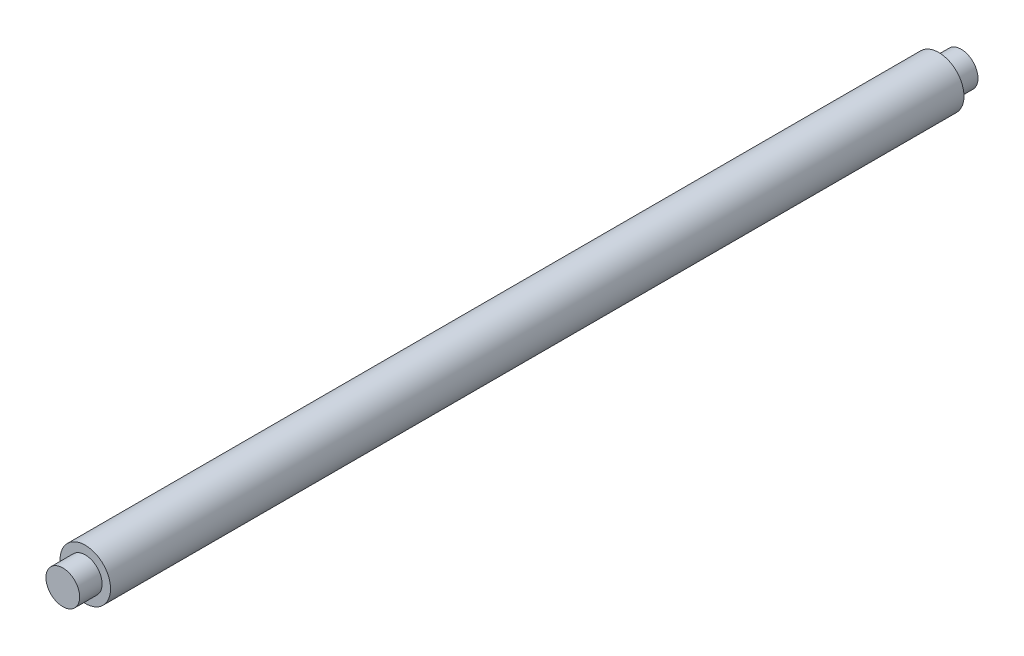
ISO-10303-21;
HEADER;
FILE_DESCRIPTION(('STEP AP214'),'2;1');
FILE_NAME('part.step','',(''),(''),'','','');
FILE_SCHEMA(('AUTOMOTIVE_DESIGN { 1 0 10303 214 1 1 1 1 }'));
ENDSEC;
DATA;
#1=APPLICATION_CONTEXT('core data for automotive mechanical design processes');
#2=APPLICATION_PROTOCOL_DEFINITION('international standard','automotive_design',2000,#1);
#3=PRODUCT_CONTEXT('',#1,'mechanical');
#4=PRODUCT('Part','Part','',(#3));
#5=PRODUCT_RELATED_PRODUCT_CATEGORY('part','',(#4));
#6=PRODUCT_DEFINITION_FORMATION('','',#4);
#7=PRODUCT_DEFINITION_CONTEXT('part definition',#1,'design');
#8=PRODUCT_DEFINITION('design','',#6,#7);
#9=PRODUCT_DEFINITION_SHAPE('','',#8);
#10=(LENGTH_UNIT() NAMED_UNIT(*) SI_UNIT(.MILLI.,.METRE.));
#11=(NAMED_UNIT(*) PLANE_ANGLE_UNIT() SI_UNIT($,.RADIAN.));
#12=(NAMED_UNIT(*) SI_UNIT($,.STERADIAN.) SOLID_ANGLE_UNIT());
#13=UNCERTAINTY_MEASURE_WITH_UNIT(LENGTH_MEASURE(1.E-05),#10,'distance_accuracy_value','');
#14=(GEOMETRIC_REPRESENTATION_CONTEXT(3) GLOBAL_UNCERTAINTY_ASSIGNED_CONTEXT((#13)) GLOBAL_UNIT_ASSIGNED_CONTEXT((#10,
#11,#12)) REPRESENTATION_CONTEXT('',''));
#15=CARTESIAN_POINT('',(0.,0.,0.));
#16=DIRECTION('',(0.,0.,1.));
#17=DIRECTION('',(1.,0.,0.));
#18=AXIS2_PLACEMENT_3D('',#15,#16,#17);
#19=CARTESIAN_POINT('',(0.,0.,38.));
#20=DIRECTION('',(0.,0.,1.));
#21=DIRECTION('',(1.,0.,0.));
#22=AXIS2_PLACEMENT_3D('',#19,#20,#21);
#23=PLANE('',#22);
#24=CARTESIAN_POINT('',(0.,0.,38.));
#25=DIRECTION('',(0.,0.,1.));
#26=DIRECTION('',(1.,0.,0.));
#27=AXIS2_PLACEMENT_3D('',#24,#25,#26);
#28=CIRCLE('',#27,2.25);
#29=CARTESIAN_POINT('',(2.25,0.,38.));
#30=VERTEX_POINT('',#29);
#31=EDGE_CURVE('E10',#30,#30,#28,.T.);
#32=ORIENTED_EDGE('',*,*,#31,.T.);
#33=EDGE_LOOP('',(#32));
#34=FACE_BOUND('',#33,.T.);
#35=CARTESIAN_POINT('',(0.,0.,38.));
#36=DIRECTION('',(0.,0.,1.));
#37=DIRECTION('',(1.,0.,0.));
#38=AXIS2_PLACEMENT_3D('',#35,#36,#37);
#39=CIRCLE('',#38,1.5);
#40=CARTESIAN_POINT('',(1.5,0.,38.));
#41=VERTEX_POINT('',#40);
#42=EDGE_CURVE('E41',#41,#41,#39,.T.);
#43=ORIENTED_EDGE('',*,*,#42,.F.);
#44=EDGE_LOOP('',(#43));
#45=FACE_BOUND('',#44,.T.);
#46=ADVANCED_FACE('F30',(#34,#45),#23,.T.);
#47=CARTESIAN_POINT('',(0.,0.,38.));
#48=DIRECTION('',(0.,0.,-1.));
#49=DIRECTION('',(-1.,0.,0.));
#50=AXIS2_PLACEMENT_3D('',#47,#48,#49);
#51=CYLINDRICAL_SURFACE('',#50,2.25);
#52=ORIENTED_EDGE('',*,*,#31,.F.);
#53=EDGE_LOOP('',(#52));
#54=FACE_BOUND('',#53,.T.);
#55=CARTESIAN_POINT('',(0.,0.,-38.));
#56=DIRECTION('',(0.,0.,1.));
#57=DIRECTION('',(1.,0.,0.));
#58=AXIS2_PLACEMENT_3D('',#55,#56,#57);
#59=CIRCLE('',#58,2.25);
#60=CARTESIAN_POINT('',(2.25,0.,-38.));
#61=VERTEX_POINT('',#60);
#62=EDGE_CURVE('E45',#61,#61,#59,.T.);
#63=ORIENTED_EDGE('',*,*,#62,.T.);
#64=EDGE_LOOP('',(#63));
#65=FACE_BOUND('',#64,.T.);
#66=ADVANCED_FACE('F32',(#54,#65),#51,.T.);
#67=CARTESIAN_POINT('',(0.,0.,40.));
#68=DIRECTION('',(0.,0.,-1.));
#69=DIRECTION('',(-1.,0.,0.));
#70=AXIS2_PLACEMENT_3D('',#67,#68,#69);
#71=CYLINDRICAL_SURFACE('',#70,1.5);
#72=CARTESIAN_POINT('',(0.,0.,40.));
#73=DIRECTION('',(0.,0.,1.));
#74=DIRECTION('',(1.,0.,0.));
#75=AXIS2_PLACEMENT_3D('',#72,#73,#74);
#76=CIRCLE('',#75,1.5);
#77=CARTESIAN_POINT('',(1.5,0.,40.));
#78=VERTEX_POINT('',#77);
#79=EDGE_CURVE('E37',#78,#78,#76,.T.);
#80=ORIENTED_EDGE('',*,*,#79,.F.);
#81=EDGE_LOOP('',(#80));
#82=FACE_BOUND('',#81,.T.);
#83=ORIENTED_EDGE('',*,*,#42,.T.);
#84=EDGE_LOOP('',(#83));
#85=FACE_BOUND('',#84,.T.);
#86=ADVANCED_FACE('F77',(#82,#85),#71,.T.);
#87=CARTESIAN_POINT('',(0.,0.,40.));
#88=DIRECTION('',(0.,0.,1.));
#89=DIRECTION('',(1.,0.,0.));
#90=AXIS2_PLACEMENT_3D('',#87,#88,#89);
#91=PLANE('',#90);
#92=ORIENTED_EDGE('',*,*,#79,.T.);
#93=EDGE_LOOP('',(#92));
#94=FACE_BOUND('',#93,.T.);
#95=ADVANCED_FACE('F70',(#94),#91,.T.);
#96=CARTESIAN_POINT('',(0.,0.,-38.));
#97=DIRECTION('',(0.,0.,-1.));
#98=DIRECTION('',(1.,0.,0.));
#99=AXIS2_PLACEMENT_3D('',#96,#97,#98);
#100=PLANE('',#99);
#101=ORIENTED_EDGE('',*,*,#62,.F.);
#102=EDGE_LOOP('',(#101));
#103=FACE_BOUND('',#102,.T.);
#104=CARTESIAN_POINT('',(0.,0.,-38.));
#105=DIRECTION('',(0.,0.,1.));
#106=DIRECTION('',(1.,0.,0.));
#107=AXIS2_PLACEMENT_3D('',#104,#105,#106);
#108=CIRCLE('',#107,1.5);
#109=CARTESIAN_POINT('',(1.5,0.,-38.));
#110=VERTEX_POINT('',#109);
#111=EDGE_CURVE('E53',#110,#110,#108,.T.);
#112=ORIENTED_EDGE('',*,*,#111,.T.);
#113=EDGE_LOOP('',(#112));
#114=FACE_BOUND('',#113,.T.);
#115=ADVANCED_FACE('F57',(#103,#114),#100,.T.);
#116=CARTESIAN_POINT('',(0.,0.,-40.));
#117=DIRECTION('',(0.,0.,1.));
#118=DIRECTION('',(-1.,0.,0.));
#119=AXIS2_PLACEMENT_3D('',#116,#117,#118);
#120=CYLINDRICAL_SURFACE('',#119,1.5);
#121=CARTESIAN_POINT('',(0.,0.,-40.));
#122=DIRECTION('',(0.,0.,1.));
#123=DIRECTION('',(1.,0.,0.));
#124=AXIS2_PLACEMENT_3D('',#121,#122,#123);
#125=CIRCLE('',#124,1.5);
#126=CARTESIAN_POINT('',(1.5,0.,-40.));
#127=VERTEX_POINT('',#126);
#128=EDGE_CURVE('E50',#127,#127,#125,.T.);
#129=ORIENTED_EDGE('',*,*,#128,.T.);
#130=EDGE_LOOP('',(#129));
#131=FACE_BOUND('',#130,.T.);
#132=ORIENTED_EDGE('',*,*,#111,.F.);
#133=EDGE_LOOP('',(#132));
#134=FACE_BOUND('',#133,.T.);
#135=ADVANCED_FACE('F59',(#131,#134),#120,.T.);
#136=CARTESIAN_POINT('',(0.,0.,-40.));
#137=DIRECTION('',(0.,0.,-1.));
#138=DIRECTION('',(1.,0.,0.));
#139=AXIS2_PLACEMENT_3D('',#136,#137,#138);
#140=PLANE('',#139);
#141=ORIENTED_EDGE('',*,*,#128,.F.);
#142=EDGE_LOOP('',(#141));
#143=FACE_BOUND('',#142,.T.);
#144=ADVANCED_FACE('F61',(#143),#140,.T.);
#145=CLOSED_SHELL('',(#46,#66,#86,#95,#115,#135,#144));
#146=MANIFOLD_SOLID_BREP('B2',#145);
#147=ADVANCED_BREP_SHAPE_REPRESENTATION('',(#18,#146),#14);
#148=SHAPE_DEFINITION_REPRESENTATION(#9,#147);
ENDSEC;
END-ISO-10303-21;
